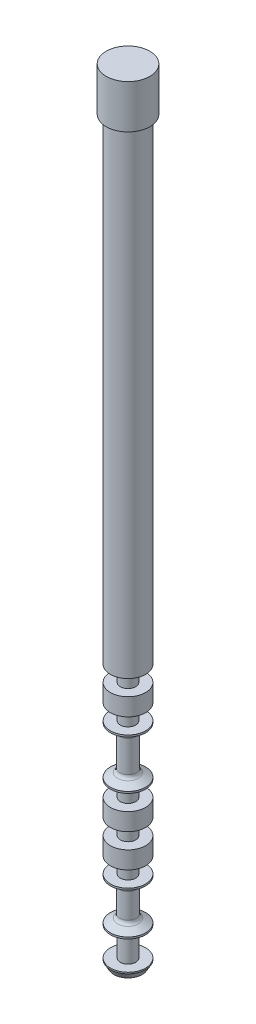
ISO-10303-21;
HEADER;
FILE_DESCRIPTION(('STEP AP214'),'2;1');
FILE_NAME('part.step','',(''),(''),'','','');
FILE_SCHEMA(('AUTOMOTIVE_DESIGN { 1 0 10303 214 1 1 1 1 }'));
ENDSEC;
DATA;
#1=APPLICATION_CONTEXT('core data for automotive mechanical design processes');
#2=APPLICATION_PROTOCOL_DEFINITION('international standard','automotive_design',2000,#1);
#3=PRODUCT_CONTEXT('',#1,'mechanical');
#4=PRODUCT('Part','Part','',(#3));
#5=PRODUCT_RELATED_PRODUCT_CATEGORY('part','',(#4));
#6=PRODUCT_DEFINITION_FORMATION('','',#4);
#7=PRODUCT_DEFINITION_CONTEXT('part definition',#1,'design');
#8=PRODUCT_DEFINITION('design','',#6,#7);
#9=PRODUCT_DEFINITION_SHAPE('','',#8);
#10=(LENGTH_UNIT() NAMED_UNIT(*) SI_UNIT(.MILLI.,.METRE.));
#11=(NAMED_UNIT(*) PLANE_ANGLE_UNIT() SI_UNIT($,.RADIAN.));
#12=(NAMED_UNIT(*) SI_UNIT($,.STERADIAN.) SOLID_ANGLE_UNIT());
#13=UNCERTAINTY_MEASURE_WITH_UNIT(LENGTH_MEASURE(1.E-05),#10,'distance_accuracy_value','');
#14=(GEOMETRIC_REPRESENTATION_CONTEXT(3) GLOBAL_UNCERTAINTY_ASSIGNED_CONTEXT((#13)) GLOBAL_UNIT_ASSIGNED_CONTEXT((#10,
#11,#12)) REPRESENTATION_CONTEXT('',''));
#15=CARTESIAN_POINT('',(0.,0.,0.));
#16=DIRECTION('',(0.,0.,1.));
#17=DIRECTION('',(1.,0.,0.));
#18=AXIS2_PLACEMENT_3D('',#15,#16,#17);
#19=CARTESIAN_POINT('',(56.88,-62.,1.65));
#20=DIRECTION('',(0.,-1.,0.));
#21=DIRECTION('',(0.,0.,-1.));
#22=AXIS2_PLACEMENT_3D('',#19,#20,#21);
#23=PLANE('',#22);
#24=CARTESIAN_POINT('',(56.,-62.0000000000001,1.65));
#25=DIRECTION('',(0.,-1.,0.));
#26=DIRECTION('',(0.,0.,-1.));
#27=AXIS2_PLACEMENT_3D('',#24,#25,#26);
#28=CIRCLE('',#27,2.02000000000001);
#29=CARTESIAN_POINT('',(56.,-62.0000000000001,-0.370000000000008));
#30=VERTEX_POINT('',#29);
#31=EDGE_CURVE('E163',#30,#30,#28,.T.);
#32=ORIENTED_EDGE('',*,*,#31,.T.);
#33=EDGE_LOOP('',(#32));
#34=FACE_BOUND('',#33,.T.);
#35=CARTESIAN_POINT('',(56.,-62.0000000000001,1.65));
#36=DIRECTION('',(0.,-1.,0.));
#37=DIRECTION('',(0.,0.,-1.));
#38=AXIS2_PLACEMENT_3D('',#35,#36,#37);
#39=CIRCLE('',#38,0.879999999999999);
#40=CARTESIAN_POINT('',(56.,-62.0000000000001,0.770000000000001));
#41=VERTEX_POINT('',#40);
#42=EDGE_CURVE('E73',#41,#41,#39,.T.);
#43=ORIENTED_EDGE('',*,*,#42,.F.);
#44=EDGE_LOOP('',(#43));
#45=FACE_BOUND('',#44,.T.);
#46=ADVANCED_FACE('F35',(#34,#45),#23,.T.);
#47=CARTESIAN_POINT('',(56.,-1065.45754338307,1.65));
#48=DIRECTION('',(0.,-1.,0.));
#49=DIRECTION('',(0.,0.,-1.));
#50=AXIS2_PLACEMENT_3D('',#47,#48,#49);
#51=CYLINDRICAL_SURFACE('',#50,0.879999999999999);
#52=ORIENTED_EDGE('',*,*,#42,.T.);
#53=EDGE_LOOP('',(#52));
#54=FACE_BOUND('',#53,.T.);
#55=CARTESIAN_POINT('',(56.,-63.8000000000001,1.65));
#56=DIRECTION('',(0.,-1.,0.));
#57=DIRECTION('',(0.,0.,-1.));
#58=AXIS2_PLACEMENT_3D('',#55,#56,#57);
#59=CIRCLE('',#58,0.879999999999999);
#60=CARTESIAN_POINT('',(56.,-63.8000000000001,0.770000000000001));
#61=VERTEX_POINT('',#60);
#62=EDGE_CURVE('E76',#61,#61,#59,.T.);
#63=ORIENTED_EDGE('',*,*,#62,.F.);
#64=EDGE_LOOP('',(#63));
#65=FACE_BOUND('',#64,.T.);
#66=ADVANCED_FACE('F186',(#54,#65),#51,.T.);
#67=CARTESIAN_POINT('',(58.02,-63.8,1.65));
#68=DIRECTION('',(0.,1.,0.));
#69=DIRECTION('',(0.,0.,1.));
#70=AXIS2_PLACEMENT_3D('',#67,#68,#69);
#71=PLANE('',#70);
#72=ORIENTED_EDGE('',*,*,#62,.T.);
#73=EDGE_LOOP('',(#72));
#74=FACE_BOUND('',#73,.T.);
#75=CARTESIAN_POINT('',(56.,-63.8000000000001,1.65));
#76=DIRECTION('',(0.,-1.,0.));
#77=DIRECTION('',(0.,0.,-1.));
#78=AXIS2_PLACEMENT_3D('',#75,#76,#77);
#79=CIRCLE('',#78,2.02);
#80=CARTESIAN_POINT('',(56.,-63.8000000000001,-0.370000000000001));
#81=VERTEX_POINT('',#80);
#82=EDGE_CURVE('E79',#81,#81,#79,.T.);
#83=ORIENTED_EDGE('',*,*,#82,.F.);
#84=EDGE_LOOP('',(#83));
#85=FACE_BOUND('',#84,.T.);
#86=ADVANCED_FACE('F191',(#74,#85),#71,.T.);
#87=CARTESIAN_POINT('',(56.,-1065.45754338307,1.65));
#88=DIRECTION('',(0.,-1.,0.));
#89=DIRECTION('',(0.,0.,-1.));
#90=AXIS2_PLACEMENT_3D('',#87,#88,#89);
#91=CYLINDRICAL_SURFACE('',#90,2.02);
#92=ORIENTED_EDGE('',*,*,#82,.T.);
#93=EDGE_LOOP('',(#92));
#94=FACE_BOUND('',#93,.T.);
#95=CARTESIAN_POINT('',(56.,-65.8,1.65));
#96=DIRECTION('',(0.,-1.,0.));
#97=DIRECTION('',(0.,0.,-1.));
#98=AXIS2_PLACEMENT_3D('',#95,#96,#97);
#99=CIRCLE('',#98,2.02);
#100=CARTESIAN_POINT('',(56.,-65.8,-0.370000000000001));
#101=VERTEX_POINT('',#100);
#102=EDGE_CURVE('E82',#101,#101,#99,.T.);
#103=ORIENTED_EDGE('',*,*,#102,.F.);
#104=EDGE_LOOP('',(#103));
#105=FACE_BOUND('',#104,.T.);
#106=ADVANCED_FACE('F245',(#94,#105),#91,.T.);
#107=CARTESIAN_POINT('',(58.02,-65.8,1.65));
#108=DIRECTION('',(0.,-1.,0.));
#109=DIRECTION('',(0.,0.,-1.));
#110=AXIS2_PLACEMENT_3D('',#107,#108,#109);
#111=PLANE('',#110);
#112=ORIENTED_EDGE('',*,*,#102,.T.);
#113=EDGE_LOOP('',(#112));
#114=FACE_BOUND('',#113,.T.);
#115=CARTESIAN_POINT('',(56.,-65.8,1.65));
#116=DIRECTION('',(0.,-1.,0.));
#117=DIRECTION('',(0.,0.,-1.));
#118=AXIS2_PLACEMENT_3D('',#115,#116,#117);
#119=CIRCLE('',#118,0.879999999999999);
#120=CARTESIAN_POINT('',(56.,-65.8,0.770000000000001));
#121=VERTEX_POINT('',#120);
#122=EDGE_CURVE('E85',#121,#121,#119,.T.);
#123=ORIENTED_EDGE('',*,*,#122,.F.);
#124=EDGE_LOOP('',(#123));
#125=FACE_BOUND('',#124,.T.);
#126=ADVANCED_FACE('F241',(#114,#125),#111,.T.);
#127=CARTESIAN_POINT('',(56.,-1065.45754338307,1.65));
#128=DIRECTION('',(0.,-1.,0.));
#129=DIRECTION('',(0.,0.,-1.));
#130=AXIS2_PLACEMENT_3D('',#127,#128,#129);
#131=CYLINDRICAL_SURFACE('',#130,0.879999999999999);
#132=ORIENTED_EDGE('',*,*,#122,.T.);
#133=EDGE_LOOP('',(#132));
#134=FACE_BOUND('',#133,.T.);
#135=CARTESIAN_POINT('',(56.,-67.6,1.65));
#136=DIRECTION('',(0.,-1.,0.));
#137=DIRECTION('',(0.,0.,-1.));
#138=AXIS2_PLACEMENT_3D('',#135,#136,#137);
#139=CIRCLE('',#138,0.879999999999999);
#140=CARTESIAN_POINT('',(56.,-67.6,0.770000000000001));
#141=VERTEX_POINT('',#140);
#142=EDGE_CURVE('E88',#141,#141,#139,.T.);
#143=ORIENTED_EDGE('',*,*,#142,.F.);
#144=EDGE_LOOP('',(#143));
#145=FACE_BOUND('',#144,.T.);
#146=ADVANCED_FACE('F237',(#134,#145),#131,.T.);
#147=CARTESIAN_POINT('',(56.88,-67.6,1.65));
#148=DIRECTION('',(0.,1.,0.));
#149=DIRECTION('',(0.,0.,1.));
#150=AXIS2_PLACEMENT_3D('',#147,#148,#149);
#151=PLANE('',#150);
#152=ORIENTED_EDGE('',*,*,#142,.T.);
#153=EDGE_LOOP('',(#152));
#154=FACE_BOUND('',#153,.T.);
#155=CARTESIAN_POINT('',(56.,-67.6,1.65));
#156=DIRECTION('',(0.,-1.,0.));
#157=DIRECTION('',(0.,0.,-1.));
#158=AXIS2_PLACEMENT_3D('',#155,#156,#157);
#159=CIRCLE('',#158,2.02);
#160=CARTESIAN_POINT('',(56.,-67.6,-0.370000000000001));
#161=VERTEX_POINT('',#160);
#162=EDGE_CURVE('E91',#161,#161,#159,.T.);
#163=ORIENTED_EDGE('',*,*,#162,.F.);
#164=EDGE_LOOP('',(#163));
#165=FACE_BOUND('',#164,.T.);
#166=ADVANCED_FACE('F233',(#154,#165),#151,.T.);
#167=CARTESIAN_POINT('',(56.,-1065.45754338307,1.65));
#168=DIRECTION('',(0.,-1.,0.));
#169=DIRECTION('',(0.,0.,-1.));
#170=AXIS2_PLACEMENT_3D('',#167,#168,#169);
#171=CYLINDRICAL_SURFACE('',#170,2.02);
#172=ORIENTED_EDGE('',*,*,#162,.T.);
#173=EDGE_LOOP('',(#172));
#174=FACE_BOUND('',#173,.T.);
#175=CARTESIAN_POINT('',(56.,-67.8,1.65));
#176=DIRECTION('',(0.,-1.,0.));
#177=DIRECTION('',(0.,0.,-1.));
#178=AXIS2_PLACEMENT_3D('',#175,#176,#177);
#179=CIRCLE('',#178,2.02);
#180=CARTESIAN_POINT('',(56.,-67.8,-0.370000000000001));
#181=VERTEX_POINT('',#180);
#182=EDGE_CURVE('E94',#181,#181,#179,.T.);
#183=ORIENTED_EDGE('',*,*,#182,.F.);
#184=EDGE_LOOP('',(#183));
#185=FACE_BOUND('',#184,.T.);
#186=ADVANCED_FACE('F226',(#174,#185),#171,.T.);
#187=CARTESIAN_POINT('',(56.,-68.4177647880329,1.65));
#188=DIRECTION('',(0.,1.,0.));
#189=DIRECTION('',(0.,0.,1.));
#190=AXIS2_PLACEMENT_3D('',#187,#188,#189);
#191=CONICAL_SURFACE('',#190,0.95,1.04719755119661);
#192=CARTESIAN_POINT('',(56.,-68.2734272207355,1.65));
#193=DIRECTION('',(0.,1.,0.));
#194=DIRECTION('',(0.,0.,1.));
#195=AXIS2_PLACEMENT_3D('',#192,#193,#194);
#196=CIRCLE('',#195,1.19999999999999);
#197=CARTESIAN_POINT('',(56.,-68.2734272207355,2.84999999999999));
#198=VERTEX_POINT('',#197);
#199=EDGE_CURVE('E46',#198,#198,#196,.T.);
#200=ORIENTED_EDGE('',*,*,#199,.T.);
#201=EDGE_LOOP('',(#200));
#202=FACE_BOUND('',#201,.T.);
#203=ORIENTED_EDGE('',*,*,#182,.T.);
#204=EDGE_LOOP('',(#203));
#205=FACE_BOUND('',#204,.T.);
#206=ADVANCED_FACE('F216',(#202,#205),#191,.T.);
#207=CARTESIAN_POINT('',(56.,-1065.45754338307,1.65));
#208=DIRECTION('',(0.,-1.,0.));
#209=DIRECTION('',(0.,0.,-1.));
#210=AXIS2_PLACEMENT_3D('',#207,#208,#209);
#211=CYLINDRICAL_SURFACE('',#210,0.95);
#212=CARTESIAN_POINT('',(56.,-72.2935600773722,1.65));
#213=DIRECTION('',(0.,-1.,0.));
#214=DIRECTION('',(0.,0.,-1.));
#215=AXIS2_PLACEMENT_3D('',#212,#213,#214);
#216=CIRCLE('',#215,0.95);
#217=CARTESIAN_POINT('',(56.,-72.2935600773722,0.700000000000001));
#218=VERTEX_POINT('',#217);
#219=EDGE_CURVE('E50',#218,#218,#216,.F.);
#220=ORIENTED_EDGE('',*,*,#219,.T.);
#221=EDGE_LOOP('',(#220));
#222=FACE_BOUND('',#221,.T.);
#223=CARTESIAN_POINT('',(56.,-68.7064399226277,1.65));
#224=DIRECTION('',(0.,-1.,0.));
#225=DIRECTION('',(0.,0.,-1.));
#226=AXIS2_PLACEMENT_3D('',#223,#224,#225);
#227=CIRCLE('',#226,0.95);
#228=CARTESIAN_POINT('',(56.,-68.7064399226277,0.700000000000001));
#229=VERTEX_POINT('',#228);
#230=EDGE_CURVE('E55',#229,#229,#227,.T.);
#231=ORIENTED_EDGE('',*,*,#230,.T.);
#232=EDGE_LOOP('',(#231));
#233=FACE_BOUND('',#232,.T.);
#234=ADVANCED_FACE('F213',(#222,#233),#211,.T.);
#235=CARTESIAN_POINT('',(56.,-73.2,1.65));
#236=DIRECTION('',(0.,-1.,0.));
#237=DIRECTION('',(0.,0.,-1.));
#238=AXIS2_PLACEMENT_3D('',#235,#236,#237);
#239=CONICAL_SURFACE('',#238,2.02,1.04719755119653);
#240=CARTESIAN_POINT('',(56.,-72.7265727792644,1.65));
#241=DIRECTION('',(0.,-1.,0.));
#242=DIRECTION('',(0.,0.,-1.));
#243=AXIS2_PLACEMENT_3D('',#240,#241,#242);
#244=CIRCLE('',#243,1.19999999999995);
#245=CARTESIAN_POINT('',(56.,-72.7265727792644,0.450000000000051));
#246=VERTEX_POINT('',#245);
#247=EDGE_CURVE('E58',#246,#246,#244,.T.);
#248=ORIENTED_EDGE('',*,*,#247,.T.);
#249=EDGE_LOOP('',(#248));
#250=FACE_BOUND('',#249,.T.);
#251=CARTESIAN_POINT('',(56.,-73.2,1.65));
#252=DIRECTION('',(0.,-1.,0.));
#253=DIRECTION('',(0.,0.,-1.));
#254=AXIS2_PLACEMENT_3D('',#251,#252,#253);
#255=CIRCLE('',#254,2.02);
#256=CARTESIAN_POINT('',(56.,-73.2,-0.370000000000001));
#257=VERTEX_POINT('',#256);
#258=EDGE_CURVE('E97',#257,#257,#255,.T.);
#259=ORIENTED_EDGE('',*,*,#258,.F.);
#260=EDGE_LOOP('',(#259));
#261=FACE_BOUND('',#260,.T.);
#262=ADVANCED_FACE('F215',(#250,#261),#239,.T.);
#263=CARTESIAN_POINT('',(56.,-1065.45754338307,1.65));
#264=DIRECTION('',(0.,-1.,0.));
#265=DIRECTION('',(0.,0.,-1.));
#266=AXIS2_PLACEMENT_3D('',#263,#264,#265);
#267=CYLINDRICAL_SURFACE('',#266,2.02);
#268=ORIENTED_EDGE('',*,*,#258,.T.);
#269=EDGE_LOOP('',(#268));
#270=FACE_BOUND('',#269,.T.);
#271=CARTESIAN_POINT('',(56.,-73.4,1.65));
#272=DIRECTION('',(0.,-1.,0.));
#273=DIRECTION('',(0.,0.,-1.));
#274=AXIS2_PLACEMENT_3D('',#271,#272,#273);
#275=CIRCLE('',#274,2.02);
#276=CARTESIAN_POINT('',(56.,-73.4,-0.370000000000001));
#277=VERTEX_POINT('',#276);
#278=EDGE_CURVE('E100',#277,#277,#275,.T.);
#279=ORIENTED_EDGE('',*,*,#278,.F.);
#280=EDGE_LOOP('',(#279));
#281=FACE_BOUND('',#280,.T.);
#282=ADVANCED_FACE('F223',(#270,#281),#267,.T.);
#283=CARTESIAN_POINT('',(58.02,-73.4,1.65));
#284=DIRECTION('',(0.,-1.,0.));
#285=DIRECTION('',(0.,0.,-1.));
#286=AXIS2_PLACEMENT_3D('',#283,#284,#285);
#287=PLANE('',#286);
#288=ORIENTED_EDGE('',*,*,#278,.T.);
#289=EDGE_LOOP('',(#288));
#290=FACE_BOUND('',#289,.T.);
#291=CARTESIAN_POINT('',(56.,-73.4,1.65));
#292=DIRECTION('',(0.,-1.,0.));
#293=DIRECTION('',(0.,0.,-1.));
#294=AXIS2_PLACEMENT_3D('',#291,#292,#293);
#295=CIRCLE('',#294,0.879999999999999);
#296=CARTESIAN_POINT('',(56.,-73.4,0.770000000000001));
#297=VERTEX_POINT('',#296);
#298=EDGE_CURVE('E103',#297,#297,#295,.T.);
#299=ORIENTED_EDGE('',*,*,#298,.F.);
#300=EDGE_LOOP('',(#299));
#301=FACE_BOUND('',#300,.T.);
#302=ADVANCED_FACE('F490',(#290,#301),#287,.T.);
#303=CARTESIAN_POINT('',(56.,-1065.45754338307,1.65));
#304=DIRECTION('',(0.,-1.,0.));
#305=DIRECTION('',(0.,0.,-1.));
#306=AXIS2_PLACEMENT_3D('',#303,#304,#305);
#307=CYLINDRICAL_SURFACE('',#306,0.879999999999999);
#308=ORIENTED_EDGE('',*,*,#298,.T.);
#309=EDGE_LOOP('',(#308));
#310=FACE_BOUND('',#309,.T.);
#311=CARTESIAN_POINT('',(56.,-75.2,1.65));
#312=DIRECTION('',(0.,-1.,0.));
#313=DIRECTION('',(0.,0.,-1.));
#314=AXIS2_PLACEMENT_3D('',#311,#312,#313);
#315=CIRCLE('',#314,0.879999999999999);
#316=CARTESIAN_POINT('',(56.,-75.2,0.770000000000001));
#317=VERTEX_POINT('',#316);
#318=EDGE_CURVE('E106',#317,#317,#315,.T.);
#319=ORIENTED_EDGE('',*,*,#318,.F.);
#320=EDGE_LOOP('',(#319));
#321=FACE_BOUND('',#320,.T.);
#322=ADVANCED_FACE('F486',(#310,#321),#307,.T.);
#323=CARTESIAN_POINT('',(56.88,-75.2,1.65));
#324=DIRECTION('',(0.,1.,0.));
#325=DIRECTION('',(0.,0.,1.));
#326=AXIS2_PLACEMENT_3D('',#323,#324,#325);
#327=PLANE('',#326);
#328=ORIENTED_EDGE('',*,*,#318,.T.);
#329=EDGE_LOOP('',(#328));
#330=FACE_BOUND('',#329,.T.);
#331=CARTESIAN_POINT('',(56.,-75.2,1.65));
#332=DIRECTION('',(0.,-1.,0.));
#333=DIRECTION('',(0.,0.,-1.));
#334=AXIS2_PLACEMENT_3D('',#331,#332,#333);
#335=CIRCLE('',#334,2.02);
#336=CARTESIAN_POINT('',(56.,-75.2,-0.370000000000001));
#337=VERTEX_POINT('',#336);
#338=EDGE_CURVE('E109',#337,#337,#335,.T.);
#339=ORIENTED_EDGE('',*,*,#338,.F.);
#340=EDGE_LOOP('',(#339));
#341=FACE_BOUND('',#340,.T.);
#342=ADVANCED_FACE('F482',(#330,#341),#327,.T.);
#343=CARTESIAN_POINT('',(56.,-1065.45754338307,1.65));
#344=DIRECTION('',(0.,-1.,0.));
#345=DIRECTION('',(0.,0.,-1.));
#346=AXIS2_PLACEMENT_3D('',#343,#344,#345);
#347=CYLINDRICAL_SURFACE('',#346,2.02);
#348=ORIENTED_EDGE('',*,*,#338,.T.);
#349=EDGE_LOOP('',(#348));
#350=FACE_BOUND('',#349,.T.);
#351=CARTESIAN_POINT('',(56.,-77.2,1.65));
#352=DIRECTION('',(0.,-1.,0.));
#353=DIRECTION('',(0.,0.,-1.));
#354=AXIS2_PLACEMENT_3D('',#351,#352,#353);
#355=CIRCLE('',#354,2.02);
#356=CARTESIAN_POINT('',(56.,-77.2,-0.370000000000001));
#357=VERTEX_POINT('',#356);
#358=EDGE_CURVE('E112',#357,#357,#355,.T.);
#359=ORIENTED_EDGE('',*,*,#358,.F.);
#360=EDGE_LOOP('',(#359));
#361=FACE_BOUND('',#360,.T.);
#362=ADVANCED_FACE('F478',(#350,#361),#347,.T.);
#363=CARTESIAN_POINT('',(58.02,-77.2,1.65));
#364=DIRECTION('',(0.,-1.,0.));
#365=DIRECTION('',(0.,0.,-1.));
#366=AXIS2_PLACEMENT_3D('',#363,#364,#365);
#367=PLANE('',#366);
#368=ORIENTED_EDGE('',*,*,#358,.T.);
#369=EDGE_LOOP('',(#368));
#370=FACE_BOUND('',#369,.T.);
#371=CARTESIAN_POINT('',(56.,-77.2,1.65));
#372=DIRECTION('',(0.,-1.,0.));
#373=DIRECTION('',(0.,0.,-1.));
#374=AXIS2_PLACEMENT_3D('',#371,#372,#373);
#375=CIRCLE('',#374,0.879999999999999);
#376=CARTESIAN_POINT('',(56.,-77.2,0.770000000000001));
#377=VERTEX_POINT('',#376);
#378=EDGE_CURVE('E115',#377,#377,#375,.T.);
#379=ORIENTED_EDGE('',*,*,#378,.F.);
#380=EDGE_LOOP('',(#379));
#381=FACE_BOUND('',#380,.T.);
#382=ADVANCED_FACE('F474',(#370,#381),#367,.T.);
#383=CARTESIAN_POINT('',(56.,-1065.45754338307,1.65));
#384=DIRECTION('',(0.,-1.,0.));
#385=DIRECTION('',(0.,0.,-1.));
#386=AXIS2_PLACEMENT_3D('',#383,#384,#385);
#387=CYLINDRICAL_SURFACE('',#386,0.879999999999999);
#388=ORIENTED_EDGE('',*,*,#378,.T.);
#389=EDGE_LOOP('',(#388));
#390=FACE_BOUND('',#389,.T.);
#391=CARTESIAN_POINT('',(56.,-79.,1.65));
#392=DIRECTION('',(0.,-1.,0.));
#393=DIRECTION('',(0.,0.,-1.));
#394=AXIS2_PLACEMENT_3D('',#391,#392,#393);
#395=CIRCLE('',#394,0.879999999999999);
#396=CARTESIAN_POINT('',(56.,-79.,0.770000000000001));
#397=VERTEX_POINT('',#396);
#398=EDGE_CURVE('E118',#397,#397,#395,.T.);
#399=ORIENTED_EDGE('',*,*,#398,.F.);
#400=EDGE_LOOP('',(#399));
#401=FACE_BOUND('',#400,.T.);
#402=ADVANCED_FACE('F470',(#390,#401),#387,.T.);
#403=CARTESIAN_POINT('',(56.88,-79.,1.65));
#404=DIRECTION('',(0.,1.,0.));
#405=DIRECTION('',(0.,0.,1.));
#406=AXIS2_PLACEMENT_3D('',#403,#404,#405);
#407=PLANE('',#406);
#408=ORIENTED_EDGE('',*,*,#398,.T.);
#409=EDGE_LOOP('',(#408));
#410=FACE_BOUND('',#409,.T.);
#411=CARTESIAN_POINT('',(56.,-79.,1.65));
#412=DIRECTION('',(0.,-1.,0.));
#413=DIRECTION('',(0.,0.,-1.));
#414=AXIS2_PLACEMENT_3D('',#411,#412,#413);
#415=CIRCLE('',#414,2.02);
#416=CARTESIAN_POINT('',(56.,-79.,-0.370000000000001));
#417=VERTEX_POINT('',#416);
#418=EDGE_CURVE('E121',#417,#417,#415,.T.);
#419=ORIENTED_EDGE('',*,*,#418,.F.);
#420=EDGE_LOOP('',(#419));
#421=FACE_BOUND('',#420,.T.);
#422=ADVANCED_FACE('F466',(#410,#421),#407,.T.);
#423=CARTESIAN_POINT('',(56.,-1065.45754338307,1.65));
#424=DIRECTION('',(0.,-1.,0.));
#425=DIRECTION('',(0.,0.,-1.));
#426=AXIS2_PLACEMENT_3D('',#423,#424,#425);
#427=CYLINDRICAL_SURFACE('',#426,2.02);
#428=ORIENTED_EDGE('',*,*,#418,.T.);
#429=EDGE_LOOP('',(#428));
#430=FACE_BOUND('',#429,.T.);
#431=CARTESIAN_POINT('',(56.,-81.,1.65));
#432=DIRECTION('',(0.,-1.,0.));
#433=DIRECTION('',(0.,0.,-1.));
#434=AXIS2_PLACEMENT_3D('',#431,#432,#433);
#435=CIRCLE('',#434,2.02);
#436=CARTESIAN_POINT('',(56.,-81.,-0.370000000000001));
#437=VERTEX_POINT('',#436);
#438=EDGE_CURVE('E124',#437,#437,#435,.T.);
#439=ORIENTED_EDGE('',*,*,#438,.F.);
#440=EDGE_LOOP('',(#439));
#441=FACE_BOUND('',#440,.T.);
#442=ADVANCED_FACE('F462',(#430,#441),#427,.T.);
#443=CARTESIAN_POINT('',(58.02,-81.,1.65));
#444=DIRECTION('',(0.,-1.,0.));
#445=DIRECTION('',(0.,0.,-1.));
#446=AXIS2_PLACEMENT_3D('',#443,#444,#445);
#447=PLANE('',#446);
#448=ORIENTED_EDGE('',*,*,#438,.T.);
#449=EDGE_LOOP('',(#448));
#450=FACE_BOUND('',#449,.T.);
#451=CARTESIAN_POINT('',(56.,-81.,1.65));
#452=DIRECTION('',(0.,-1.,0.));
#453=DIRECTION('',(0.,0.,-1.));
#454=AXIS2_PLACEMENT_3D('',#451,#452,#453);
#455=CIRCLE('',#454,0.879999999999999);
#456=CARTESIAN_POINT('',(56.,-81.,0.770000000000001));
#457=VERTEX_POINT('',#456);
#458=EDGE_CURVE('E127',#457,#457,#455,.T.);
#459=ORIENTED_EDGE('',*,*,#458,.F.);
#460=EDGE_LOOP('',(#459));
#461=FACE_BOUND('',#460,.T.);
#462=ADVANCED_FACE('F458',(#450,#461),#447,.T.);
#463=CARTESIAN_POINT('',(56.,-1065.45754338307,1.65));
#464=DIRECTION('',(0.,-1.,0.));
#465=DIRECTION('',(0.,0.,-1.));
#466=AXIS2_PLACEMENT_3D('',#463,#464,#465);
#467=CYLINDRICAL_SURFACE('',#466,0.879999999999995);
#468=ORIENTED_EDGE('',*,*,#458,.T.);
#469=EDGE_LOOP('',(#468));
#470=FACE_BOUND('',#469,.T.);
#471=CARTESIAN_POINT('',(56.,-82.8,1.65));
#472=DIRECTION('',(0.,-1.,0.));
#473=DIRECTION('',(0.,0.,-1.));
#474=AXIS2_PLACEMENT_3D('',#471,#472,#473);
#475=CIRCLE('',#474,0.879999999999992);
#476=CARTESIAN_POINT('',(56.,-82.8,0.770000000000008));
#477=VERTEX_POINT('',#476);
#478=EDGE_CURVE('E130',#477,#477,#475,.T.);
#479=ORIENTED_EDGE('',*,*,#478,.F.);
#480=EDGE_LOOP('',(#479));
#481=FACE_BOUND('',#480,.T.);
#482=ADVANCED_FACE('F454',(#470,#481),#467,.T.);
#483=CARTESIAN_POINT('',(56.88,-82.8,1.65));
#484=DIRECTION('',(0.,1.,0.));
#485=DIRECTION('',(0.,0.,1.));
#486=AXIS2_PLACEMENT_3D('',#483,#484,#485);
#487=PLANE('',#486);
#488=ORIENTED_EDGE('',*,*,#478,.T.);
#489=EDGE_LOOP('',(#488));
#490=FACE_BOUND('',#489,.T.);
#491=CARTESIAN_POINT('',(56.,-82.8,1.65));
#492=DIRECTION('',(0.,-1.,0.));
#493=DIRECTION('',(0.,0.,-1.));
#494=AXIS2_PLACEMENT_3D('',#491,#492,#493);
#495=CIRCLE('',#494,2.02000000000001);
#496=CARTESIAN_POINT('',(56.,-82.8,-0.370000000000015));
#497=VERTEX_POINT('',#496);
#498=EDGE_CURVE('E133',#497,#497,#495,.T.);
#499=ORIENTED_EDGE('',*,*,#498,.F.);
#500=EDGE_LOOP('',(#499));
#501=FACE_BOUND('',#500,.T.);
#502=ADVANCED_FACE('F450',(#490,#501),#487,.T.);
#503=CARTESIAN_POINT('',(56.,-1065.45754338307,1.65));
#504=DIRECTION('',(0.,-1.,0.));
#505=DIRECTION('',(0.,0.,-1.));
#506=AXIS2_PLACEMENT_3D('',#503,#504,#505);
#507=CYLINDRICAL_SURFACE('',#506,2.02000000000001);
#508=ORIENTED_EDGE('',*,*,#498,.T.);
#509=EDGE_LOOP('',(#508));
#510=FACE_BOUND('',#509,.T.);
#511=CARTESIAN_POINT('',(56.,-83.,1.65));
#512=DIRECTION('',(0.,-1.,0.));
#513=DIRECTION('',(0.,0.,-1.));
#514=AXIS2_PLACEMENT_3D('',#511,#512,#513);
#515=CIRCLE('',#514,2.02000000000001);
#516=CARTESIAN_POINT('',(56.,-83.,-0.370000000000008));
#517=VERTEX_POINT('',#516);
#518=EDGE_CURVE('E136',#517,#517,#515,.T.);
#519=ORIENTED_EDGE('',*,*,#518,.F.);
#520=EDGE_LOOP('',(#519));
#521=FACE_BOUND('',#520,.T.);
#522=ADVANCED_FACE('F321',(#510,#521),#507,.T.);
#523=CARTESIAN_POINT('',(56.,-83.617764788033,1.65));
#524=DIRECTION('',(0.,1.,0.));
#525=DIRECTION('',(0.,0.,1.));
#526=AXIS2_PLACEMENT_3D('',#523,#524,#525);
#527=CONICAL_SURFACE('',#526,0.95,1.04719755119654);
#528=CARTESIAN_POINT('',(56.,-83.4734272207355,1.65));
#529=DIRECTION('',(0.,1.,0.));
#530=DIRECTION('',(0.,0.,1.));
#531=AXIS2_PLACEMENT_3D('',#528,#529,#530);
#532=CIRCLE('',#531,1.19999999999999);
#533=CARTESIAN_POINT('',(56.,-83.4734272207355,2.84999999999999));
#534=VERTEX_POINT('',#533);
#535=EDGE_CURVE('E61',#534,#534,#532,.T.);
#536=ORIENTED_EDGE('',*,*,#535,.T.);
#537=EDGE_LOOP('',(#536));
#538=FACE_BOUND('',#537,.T.);
#539=ORIENTED_EDGE('',*,*,#518,.T.);
#540=EDGE_LOOP('',(#539));
#541=FACE_BOUND('',#540,.T.);
#542=ADVANCED_FACE('F315',(#538,#541),#527,.T.);
#543=CARTESIAN_POINT('',(56.,-1065.45754338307,1.65));
#544=DIRECTION('',(0.,-1.,0.));
#545=DIRECTION('',(0.,0.,-1.));
#546=AXIS2_PLACEMENT_3D('',#543,#544,#545);
#547=CYLINDRICAL_SURFACE('',#546,0.95);
#548=CARTESIAN_POINT('',(56.,-86.7435600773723,1.65));
#549=DIRECTION('',(0.,-1.,0.));
#550=DIRECTION('',(0.,0.,-1.));
#551=AXIS2_PLACEMENT_3D('',#548,#549,#550);
#552=CIRCLE('',#551,0.95);
#553=CARTESIAN_POINT('',(56.,-86.7435600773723,0.700000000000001));
#554=VERTEX_POINT('',#553);
#555=EDGE_CURVE('E64',#554,#554,#552,.F.);
#556=ORIENTED_EDGE('',*,*,#555,.T.);
#557=EDGE_LOOP('',(#556));
#558=FACE_BOUND('',#557,.T.);
#559=CARTESIAN_POINT('',(56.,-83.9064399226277,1.65));
#560=DIRECTION('',(0.,-1.,0.));
#561=DIRECTION('',(0.,0.,-1.));
#562=AXIS2_PLACEMENT_3D('',#559,#560,#561);
#563=CIRCLE('',#562,0.95);
#564=CARTESIAN_POINT('',(56.,-83.9064399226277,0.700000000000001));
#565=VERTEX_POINT('',#564);
#566=EDGE_CURVE('E67',#565,#565,#563,.T.);
#567=ORIENTED_EDGE('',*,*,#566,.T.);
#568=EDGE_LOOP('',(#567));
#569=FACE_BOUND('',#568,.T.);
#570=ADVANCED_FACE('F320',(#558,#569),#547,.T.);
#571=CARTESIAN_POINT('',(56.,-87.65,1.65));
#572=DIRECTION('',(0.,-1.,0.));
#573=DIRECTION('',(0.,0.,-1.));
#574=AXIS2_PLACEMENT_3D('',#571,#572,#573);
#575=CONICAL_SURFACE('',#574,2.02000000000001,1.04719755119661);
#576=CARTESIAN_POINT('',(56.,-87.1765727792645,1.65));
#577=DIRECTION('',(0.,-1.,0.));
#578=DIRECTION('',(0.,0.,-1.));
#579=AXIS2_PLACEMENT_3D('',#576,#577,#578);
#580=CIRCLE('',#579,1.19999999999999);
#581=CARTESIAN_POINT('',(56.,-87.1765727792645,0.450000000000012));
#582=VERTEX_POINT('',#581);
#583=EDGE_CURVE('E70',#582,#582,#580,.T.);
#584=ORIENTED_EDGE('',*,*,#583,.T.);
#585=EDGE_LOOP('',(#584));
#586=FACE_BOUND('',#585,.T.);
#587=CARTESIAN_POINT('',(56.,-87.65,1.65));
#588=DIRECTION('',(0.,-1.,0.));
#589=DIRECTION('',(0.,0.,-1.));
#590=AXIS2_PLACEMENT_3D('',#587,#588,#589);
#591=CIRCLE('',#590,2.02000000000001);
#592=CARTESIAN_POINT('',(56.,-87.65,-0.370000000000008));
#593=VERTEX_POINT('',#592);
#594=EDGE_CURVE('E139',#593,#593,#591,.T.);
#595=ORIENTED_EDGE('',*,*,#594,.F.);
#596=EDGE_LOOP('',(#595));
#597=FACE_BOUND('',#596,.T.);
#598=ADVANCED_FACE('F333',(#586,#597),#575,.T.);
#599=CARTESIAN_POINT('',(56.,-1065.45754338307,1.65));
#600=DIRECTION('',(0.,-1.,0.));
#601=DIRECTION('',(0.,0.,-1.));
#602=AXIS2_PLACEMENT_3D('',#599,#600,#601);
#603=CYLINDRICAL_SURFACE('',#602,2.02000000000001);
#604=ORIENTED_EDGE('',*,*,#594,.T.);
#605=EDGE_LOOP('',(#604));
#606=FACE_BOUND('',#605,.T.);
#607=CARTESIAN_POINT('',(56.,-87.85,1.65));
#608=DIRECTION('',(0.,-1.,0.));
#609=DIRECTION('',(0.,0.,-1.));
#610=AXIS2_PLACEMENT_3D('',#607,#608,#609);
#611=CIRCLE('',#610,2.02000000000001);
#612=CARTESIAN_POINT('',(56.,-87.85,-0.370000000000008));
#613=VERTEX_POINT('',#612);
#614=EDGE_CURVE('E142',#613,#613,#611,.T.);
#615=ORIENTED_EDGE('',*,*,#614,.F.);
#616=EDGE_LOOP('',(#615));
#617=FACE_BOUND('',#616,.T.);
#618=ADVANCED_FACE('F343',(#606,#617),#603,.T.);
#619=CARTESIAN_POINT('',(58.02,-87.85,1.65));
#620=DIRECTION('',(0.,-1.,0.));
#621=DIRECTION('',(0.,0.,-1.));
#622=AXIS2_PLACEMENT_3D('',#619,#620,#621);
#623=PLANE('',#622);
#624=ORIENTED_EDGE('',*,*,#614,.T.);
#625=EDGE_LOOP('',(#624));
#626=FACE_BOUND('',#625,.T.);
#627=CARTESIAN_POINT('',(56.,-87.85,1.65));
#628=DIRECTION('',(0.,-1.,0.));
#629=DIRECTION('',(0.,0.,-1.));
#630=AXIS2_PLACEMENT_3D('',#627,#628,#629);
#631=CIRCLE('',#630,0.879999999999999);
#632=CARTESIAN_POINT('',(56.,-87.85,0.770000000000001));
#633=VERTEX_POINT('',#632);
#634=EDGE_CURVE('E145',#633,#633,#631,.T.);
#635=ORIENTED_EDGE('',*,*,#634,.F.);
#636=EDGE_LOOP('',(#635));
#637=FACE_BOUND('',#636,.T.);
#638=ADVANCED_FACE('F442',(#626,#637),#623,.T.);
#639=CARTESIAN_POINT('',(56.,-1065.45754338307,1.65));
#640=DIRECTION('',(0.,-1.,0.));
#641=DIRECTION('',(0.,0.,-1.));
#642=AXIS2_PLACEMENT_3D('',#639,#640,#641);
#643=CYLINDRICAL_SURFACE('',#642,0.879999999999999);
#644=ORIENTED_EDGE('',*,*,#634,.T.);
#645=EDGE_LOOP('',(#644));
#646=FACE_BOUND('',#645,.T.);
#647=CARTESIAN_POINT('',(56.,-91.1500000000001,1.65));
#648=DIRECTION('',(0.,-1.,0.));
#649=DIRECTION('',(0.,0.,-1.));
#650=AXIS2_PLACEMENT_3D('',#647,#648,#649);
#651=CIRCLE('',#650,0.879999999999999);
#652=CARTESIAN_POINT('',(56.,-91.1500000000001,0.770000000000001));
#653=VERTEX_POINT('',#652);
#654=EDGE_CURVE('E148',#653,#653,#651,.T.);
#655=ORIENTED_EDGE('',*,*,#654,.F.);
#656=EDGE_LOOP('',(#655));
#657=FACE_BOUND('',#656,.T.);
#658=ADVANCED_FACE('F438',(#646,#657),#643,.T.);
#659=CARTESIAN_POINT('',(56.88,-91.15,1.65));
#660=DIRECTION('',(0.,1.,0.));
#661=DIRECTION('',(0.,0.,1.));
#662=AXIS2_PLACEMENT_3D('',#659,#660,#661);
#663=PLANE('',#662);
#664=ORIENTED_EDGE('',*,*,#654,.T.);
#665=EDGE_LOOP('',(#664));
#666=FACE_BOUND('',#665,.T.);
#667=CARTESIAN_POINT('',(56.,-91.1500000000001,1.65));
#668=DIRECTION('',(0.,-1.,0.));
#669=DIRECTION('',(0.,0.,-1.));
#670=AXIS2_PLACEMENT_3D('',#667,#668,#669);
#671=CIRCLE('',#670,2.02000000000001);
#672=CARTESIAN_POINT('',(56.,-91.1500000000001,-0.370000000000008));
#673=VERTEX_POINT('',#672);
#674=EDGE_CURVE('E151',#673,#673,#671,.T.);
#675=ORIENTED_EDGE('',*,*,#674,.F.);
#676=EDGE_LOOP('',(#675));
#677=FACE_BOUND('',#676,.T.);
#678=ADVANCED_FACE('F380',(#666,#677),#663,.T.);
#679=CARTESIAN_POINT('',(56.,-1065.45754338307,1.65));
#680=DIRECTION('',(0.,-1.,0.));
#681=DIRECTION('',(0.,0.,-1.));
#682=AXIS2_PLACEMENT_3D('',#679,#680,#681);
#683=CYLINDRICAL_SURFACE('',#682,2.02000000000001);
#684=CARTESIAN_POINT('',(56.,-91.3071796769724,1.65));
#685=DIRECTION('',(0.,-1.,0.));
#686=DIRECTION('',(0.,0.,-1.));
#687=AXIS2_PLACEMENT_3D('',#684,#685,#686);
#688=CIRCLE('',#687,2.02000000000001);
#689=CARTESIAN_POINT('',(56.,-91.3071796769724,-0.370000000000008));
#690=VERTEX_POINT('',#689);
#691=EDGE_CURVE('E10',#690,#690,#688,.F.);
#692=ORIENTED_EDGE('',*,*,#691,.T.);
#693=EDGE_LOOP('',(#692));
#694=FACE_BOUND('',#693,.T.);
#695=ORIENTED_EDGE('',*,*,#674,.T.);
#696=EDGE_LOOP('',(#695));
#697=FACE_BOUND('',#696,.T.);
#698=ADVANCED_FACE('F374',(#694,#697),#683,.T.);
#699=CARTESIAN_POINT('',(58.02,-92.,1.65));
#700=DIRECTION('',(0.,-1.,0.));
#701=DIRECTION('',(0.,0.,-1.));
#702=AXIS2_PLACEMENT_3D('',#699,#700,#701);
#703=PLANE('',#702);
#704=CARTESIAN_POINT('',(56.,-92.,1.65));
#705=DIRECTION('',(0.,-1.,0.));
#706=DIRECTION('',(0.,0.,-1.));
#707=AXIS2_PLACEMENT_3D('',#704,#705,#706);
#708=CIRCLE('',#707,1.62);
#709=CARTESIAN_POINT('',(56.,-92.,0.0299999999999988));
#710=VERTEX_POINT('',#709);
#711=EDGE_CURVE('E42',#710,#710,#708,.T.);
#712=ORIENTED_EDGE('',*,*,#711,.T.);
#713=EDGE_LOOP('',(#712));
#714=FACE_BOUND('',#713,.T.);
#715=ADVANCED_FACE('F379',(#714),#703,.T.);
#716=CARTESIAN_POINT('',(58.5,-2.4,1.65));
#717=DIRECTION('',(0.,1.,0.));
#718=DIRECTION('',(0.,0.,1.));
#719=AXIS2_PLACEMENT_3D('',#716,#717,#718);
#720=PLANE('',#719);
#721=CARTESIAN_POINT('',(56.,-2.39999999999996,1.65));
#722=DIRECTION('',(0.,-1.,0.));
#723=DIRECTION('',(0.,0.,-1.));
#724=AXIS2_PLACEMENT_3D('',#721,#722,#723);
#725=CIRCLE('',#724,2.5);
#726=CARTESIAN_POINT('',(56.,-2.39999999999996,-0.850000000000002));
#727=VERTEX_POINT('',#726);
#728=EDGE_CURVE('E154',#727,#727,#725,.T.);
#729=ORIENTED_EDGE('',*,*,#728,.F.);
#730=EDGE_LOOP('',(#729));
#731=FACE_BOUND('',#730,.T.);
#732=ADVANCED_FACE('F391',(#731),#720,.T.);
#733=CARTESIAN_POINT('',(56.,-1065.45754338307,1.65));
#734=DIRECTION('',(0.,-1.,0.));
#735=DIRECTION('',(0.,0.,-1.));
#736=AXIS2_PLACEMENT_3D('',#733,#734,#735);
#737=CYLINDRICAL_SURFACE('',#736,2.5);
#738=ORIENTED_EDGE('',*,*,#728,.T.);
#739=EDGE_LOOP('',(#738));
#740=FACE_BOUND('',#739,.T.);
#741=CARTESIAN_POINT('',(56.,-7.40000000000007,1.65));
#742=DIRECTION('',(0.,-1.,0.));
#743=DIRECTION('',(0.,0.,-1.));
#744=AXIS2_PLACEMENT_3D('',#741,#742,#743);
#745=CIRCLE('',#744,2.5);
#746=CARTESIAN_POINT('',(56.,-7.40000000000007,-0.850000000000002));
#747=VERTEX_POINT('',#746);
#748=EDGE_CURVE('E157',#747,#747,#745,.T.);
#749=ORIENTED_EDGE('',*,*,#748,.F.);
#750=EDGE_LOOP('',(#749));
#751=FACE_BOUND('',#750,.T.);
#752=ADVANCED_FACE('F182',(#740,#751),#737,.T.);
#753=CARTESIAN_POINT('',(58.02,-7.4,1.65));
#754=DIRECTION('',(0.,-1.,0.));
#755=DIRECTION('',(0.,0.,-1.));
#756=AXIS2_PLACEMENT_3D('',#753,#754,#755);
#757=PLANE('',#756);
#758=ORIENTED_EDGE('',*,*,#748,.T.);
#759=EDGE_LOOP('',(#758));
#760=FACE_BOUND('',#759,.T.);
#761=CARTESIAN_POINT('',(56.,-7.40000000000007,1.65));
#762=DIRECTION('',(0.,-1.,0.));
#763=DIRECTION('',(0.,0.,-1.));
#764=AXIS2_PLACEMENT_3D('',#761,#762,#763);
#765=CIRCLE('',#764,2.02);
#766=CARTESIAN_POINT('',(56.,-7.40000000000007,-0.370000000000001));
#767=VERTEX_POINT('',#766);
#768=EDGE_CURVE('E160',#767,#767,#765,.T.);
#769=ORIENTED_EDGE('',*,*,#768,.F.);
#770=EDGE_LOOP('',(#769));
#771=FACE_BOUND('',#770,.T.);
#772=ADVANCED_FACE('F172',(#760,#771),#757,.T.);
#773=CARTESIAN_POINT('',(56.,-1065.45754338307,1.65));
#774=DIRECTION('',(0.,-1.,0.));
#775=DIRECTION('',(0.,0.,-1.));
#776=AXIS2_PLACEMENT_3D('',#773,#774,#775);
#777=CYLINDRICAL_SURFACE('',#776,2.02);
#778=ORIENTED_EDGE('',*,*,#768,.T.);
#779=EDGE_LOOP('',(#778));
#780=FACE_BOUND('',#779,.T.);
#781=ORIENTED_EDGE('',*,*,#31,.F.);
#782=EDGE_LOOP('',(#781));
#783=FACE_BOUND('',#782,.T.);
#784=ADVANCED_FACE('F169',(#780,#783),#777,.T.);
#785=CARTESIAN_POINT('',(56.,-86.7435600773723,1.65));
#786=DIRECTION('',(0.,-1.,0.));
#787=DIRECTION('',(0.,0.,-1.));
#788=AXIS2_PLACEMENT_3D('',#785,#786,#787);
#789=TOROIDAL_SURFACE('',#788,1.45,0.5);
#790=ORIENTED_EDGE('',*,*,#555,.F.);
#791=EDGE_LOOP('',(#790));
#792=FACE_BOUND('',#791,.T.);
#793=ORIENTED_EDGE('',*,*,#583,.F.);
#794=EDGE_LOOP('',(#793));
#795=FACE_BOUND('',#794,.T.);
#796=ADVANCED_FACE('F171',(#792,#795),#789,.F.);
#797=CARTESIAN_POINT('',(56.,-83.9064399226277,1.65));
#798=DIRECTION('',(0.,-1.,0.));
#799=DIRECTION('',(0.,0.,-1.));
#800=AXIS2_PLACEMENT_3D('',#797,#798,#799);
#801=TOROIDAL_SURFACE('',#800,1.45,0.5);
#802=ORIENTED_EDGE('',*,*,#535,.F.);
#803=EDGE_LOOP('',(#802));
#804=FACE_BOUND('',#803,.T.);
#805=ORIENTED_EDGE('',*,*,#566,.F.);
#806=EDGE_LOOP('',(#805));
#807=FACE_BOUND('',#806,.T.);
#808=ADVANCED_FACE('F179',(#804,#807),#801,.F.);
#809=CARTESIAN_POINT('',(56.,-72.2935600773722,1.65));
#810=DIRECTION('',(0.,-1.,0.));
#811=DIRECTION('',(0.,0.,-1.));
#812=AXIS2_PLACEMENT_3D('',#809,#810,#811);
#813=TOROIDAL_SURFACE('',#812,1.45,0.5);
#814=ORIENTED_EDGE('',*,*,#219,.F.);
#815=EDGE_LOOP('',(#814));
#816=FACE_BOUND('',#815,.T.);
#817=ORIENTED_EDGE('',*,*,#247,.F.);
#818=EDGE_LOOP('',(#817));
#819=FACE_BOUND('',#818,.T.);
#820=ADVANCED_FACE('F198',(#816,#819),#813,.F.);
#821=CARTESIAN_POINT('',(56.,-68.7064399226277,1.65));
#822=DIRECTION('',(0.,-1.,0.));
#823=DIRECTION('',(0.,0.,-1.));
#824=AXIS2_PLACEMENT_3D('',#821,#822,#823);
#825=TOROIDAL_SURFACE('',#824,1.45,0.5);
#826=ORIENTED_EDGE('',*,*,#199,.F.);
#827=EDGE_LOOP('',(#826));
#828=FACE_BOUND('',#827,.T.);
#829=ORIENTED_EDGE('',*,*,#230,.F.);
#830=EDGE_LOOP('',(#829));
#831=FACE_BOUND('',#830,.T.);
#832=ADVANCED_FACE('F201',(#828,#831),#825,.F.);
#833=CARTESIAN_POINT('',(56.,-92.,1.65));
#834=DIRECTION('',(0.,1.,0.));
#835=DIRECTION('',(0.,0.,1.));
#836=AXIS2_PLACEMENT_3D('',#833,#834,#835);
#837=CONICAL_SURFACE('',#836,1.62000000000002,0.523598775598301);
#838=ORIENTED_EDGE('',*,*,#691,.F.);
#839=EDGE_LOOP('',(#838));
#840=FACE_BOUND('',#839,.T.);
#841=ORIENTED_EDGE('',*,*,#711,.F.);
#842=EDGE_LOOP('',(#841));
#843=FACE_BOUND('',#842,.T.);
#844=ADVANCED_FACE('F37',(#840,#843),#837,.T.);
#845=CLOSED_SHELL('',(#46,#66,#86,#106,#126,#146,#166,#186,#206,#234,#262,#282,#302,#322,#342,
#362,#382,#402,#422,#442,#462,#482,#502,#522,#542,#570,#598,#618,#638,#658,#678,#698,#715,#732,
#752,#772,#784,#796,#808,#820,#832,#844));
#846=MANIFOLD_SOLID_BREP('B2',#845);
#847=ADVANCED_BREP_SHAPE_REPRESENTATION('',(#18,#846),#14);
#848=SHAPE_DEFINITION_REPRESENTATION(#9,#847);
ENDSEC;
END-ISO-10303-21;
